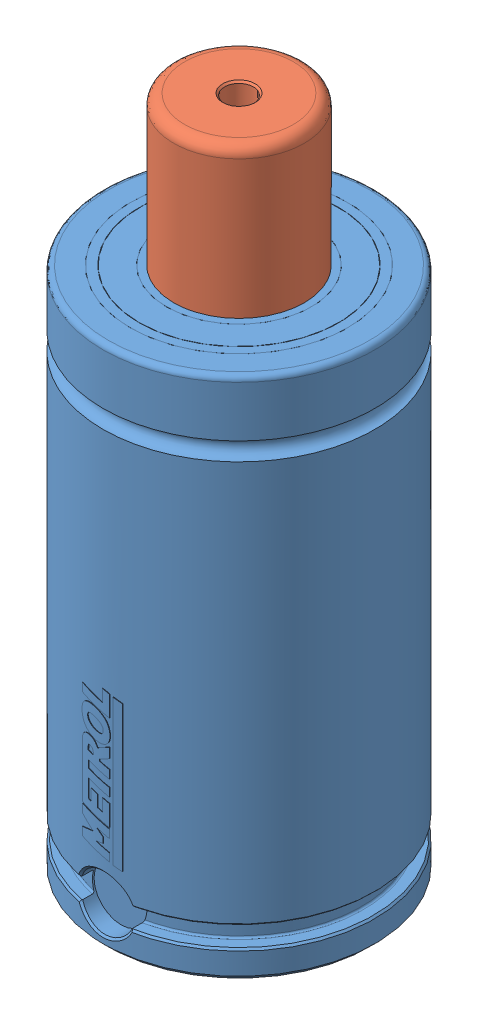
SolidWorks assembly ISNG1500-038.SLDASM, configuration Default (file format 7000). Lengths in mm.
Overall size (75 186 75.11).
2 component instances, 2 part files, 5 mates.
Components (placement in the parent):
- ISNG-1500 Body-1: ISNG-1500 Body.SLDPRT [ISNG-1500-38.1] x (0 0 1) z (0 -1 0) size (75.11 75 144.9)
- ISNG-1500 Piston-1: ISNG-1500 Piston.SLDPRT [ISNG-1500-38.1] at (0 119.9 0) x (-0.997911 0 -0.064605) z (0 -1 0) size (50 50 66.1)
Mates (geometry in assembly coordinates):
- Concentric1: concentric aligned: cylinder of ISNG-1500 Body-1 through (0 0 0) axis (0 -1 0) radius 18; cylinder of ISNG-1500 Piston-1 through (0 119.9 0) axis (0 -1 0) radius 18
- LimitDistance1: limit distance anti-aligned: plane of ISNG-1500 Body-1 through (-18 124.9 0) normal (0 -1 0); plane of ISNG-1500 Piston-1 through (1.6151 124.9 -24.9478) normal (0 1 0)
- Coincident1: coincident anti-aligned: plane of ISNG-1500 Body-1 through (0 0 0) normal (0 -1 0); plane of assembly through (0 0 0) normal (0 1 0)
- Coincident2: coincident anti-aligned: plane of ISNG-1500 Body-1; plane of assembly through (0 0 0) normal (1 0 0)
- Coincident4: coincident aligned: plane of ISNG-1500 Body-1; plane of assembly through (0 0 0) normal (0 0 1)
